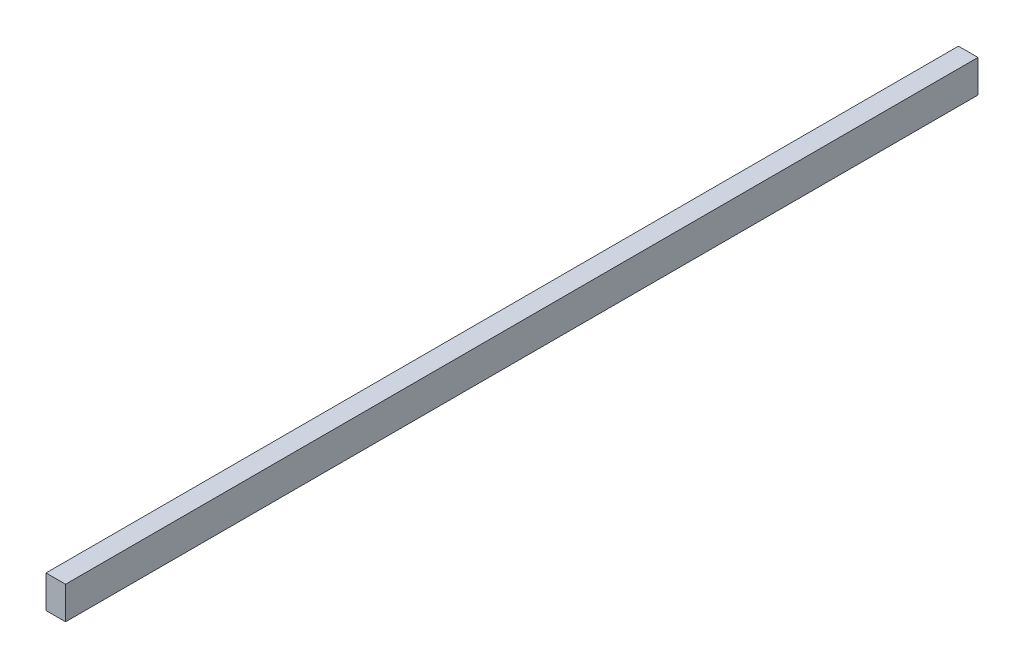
ISO-10303-21;
HEADER;
FILE_DESCRIPTION(('STEP AP214'),'2;1');
FILE_NAME('part.step','',(''),(''),'','','');
FILE_SCHEMA(('AUTOMOTIVE_DESIGN { 1 0 10303 214 1 1 1 1 }'));
ENDSEC;
DATA;
#1=APPLICATION_CONTEXT('core data for automotive mechanical design processes');
#2=APPLICATION_PROTOCOL_DEFINITION('international standard','automotive_design',2000,#1);
#3=PRODUCT_CONTEXT('',#1,'mechanical');
#4=PRODUCT('Part','Part','',(#3));
#5=PRODUCT_RELATED_PRODUCT_CATEGORY('part','',(#4));
#6=PRODUCT_DEFINITION_FORMATION('','',#4);
#7=PRODUCT_DEFINITION_CONTEXT('part definition',#1,'design');
#8=PRODUCT_DEFINITION('design','',#6,#7);
#9=PRODUCT_DEFINITION_SHAPE('','',#8);
#10=(LENGTH_UNIT() NAMED_UNIT(*) SI_UNIT(.MILLI.,.METRE.));
#11=(NAMED_UNIT(*) PLANE_ANGLE_UNIT() SI_UNIT($,.RADIAN.));
#12=(NAMED_UNIT(*) SI_UNIT($,.STERADIAN.) SOLID_ANGLE_UNIT());
#13=UNCERTAINTY_MEASURE_WITH_UNIT(LENGTH_MEASURE(1.E-05),#10,'distance_accuracy_value','');
#14=(GEOMETRIC_REPRESENTATION_CONTEXT(3) GLOBAL_UNCERTAINTY_ASSIGNED_CONTEXT((#13)) GLOBAL_UNIT_ASSIGNED_CONTEXT((#10,
#11,#12)) REPRESENTATION_CONTEXT('',''));
#15=CARTESIAN_POINT('',(0.,0.,0.));
#16=DIRECTION('',(0.,0.,1.));
#17=DIRECTION('',(1.,0.,0.));
#18=AXIS2_PLACEMENT_3D('',#15,#16,#17);
#19=CARTESIAN_POINT('',(0.,0.,840.));
#20=DIRECTION('',(1.,0.,0.));
#21=DIRECTION('',(0.,0.,-1.));
#22=AXIS2_PLACEMENT_3D('',#19,#20,#21);
#23=PLANE('',#22);
#24=DIRECTION('',(0.,-1.,0.));
#25=VECTOR('',#24,1.);
#26=CARTESIAN_POINT('',(0.,0.,0.));
#27=LINE('',#26,#25);
#28=CARTESIAN_POINT('',(0.,30.,0.));
#29=VERTEX_POINT('',#28);
#30=CARTESIAN_POINT('',(0.,0.,0.));
#31=VERTEX_POINT('',#30);
#32=EDGE_CURVE('E70',#29,#31,#27,.T.);
#33=ORIENTED_EDGE('',*,*,#32,.T.);
#34=DIRECTION('',(0.,0.,-1.));
#35=VECTOR('',#34,1.);
#36=CARTESIAN_POINT('',(0.,0.,840.));
#37=LINE('',#36,#35);
#38=CARTESIAN_POINT('',(0.,0.,840.));
#39=VERTEX_POINT('',#38);
#40=EDGE_CURVE('E11',#39,#31,#37,.T.);
#41=ORIENTED_EDGE('',*,*,#40,.F.);
#42=DIRECTION('',(0.,-1.,0.));
#43=VECTOR('',#42,1.);
#44=CARTESIAN_POINT('',(0.,0.,840.));
#45=LINE('',#44,#43);
#46=CARTESIAN_POINT('',(0.,30.,840.));
#47=VERTEX_POINT('',#46);
#48=EDGE_CURVE('E88',#47,#39,#45,.T.);
#49=ORIENTED_EDGE('',*,*,#48,.F.);
#50=DIRECTION('',(0.,0.,-1.));
#51=VECTOR('',#50,1.);
#52=CARTESIAN_POINT('',(0.,30.,840.));
#53=LINE('',#52,#51);
#54=EDGE_CURVE('E82',#47,#29,#53,.T.);
#55=ORIENTED_EDGE('',*,*,#54,.T.);
#56=EDGE_LOOP('',(#33,#41,#49,#55));
#57=FACE_BOUND('',#56,.T.);
#58=ADVANCED_FACE('F26',(#57),#23,.F.);
#59=CARTESIAN_POINT('',(0.,0.,840.));
#60=DIRECTION('',(0.,1.,0.));
#61=DIRECTION('',(0.,0.,1.));
#62=AXIS2_PLACEMENT_3D('',#59,#60,#61);
#63=PLANE('',#62);
#64=DIRECTION('',(1.,0.,0.));
#65=VECTOR('',#64,1.);
#66=CARTESIAN_POINT('',(0.,0.,0.));
#67=LINE('',#66,#65);
#68=CARTESIAN_POINT('',(18.,0.,0.));
#69=VERTEX_POINT('',#68);
#70=EDGE_CURVE('E66',#31,#69,#67,.T.);
#71=ORIENTED_EDGE('',*,*,#70,.T.);
#72=DIRECTION('',(0.,0.,-1.));
#73=VECTOR('',#72,1.);
#74=CARTESIAN_POINT('',(18.,0.,840.));
#75=LINE('',#74,#73);
#76=CARTESIAN_POINT('',(18.,0.,840.));
#77=VERTEX_POINT('',#76);
#78=EDGE_CURVE('E33',#77,#69,#75,.T.);
#79=ORIENTED_EDGE('',*,*,#78,.F.);
#80=DIRECTION('',(1.,0.,0.));
#81=VECTOR('',#80,1.);
#82=CARTESIAN_POINT('',(0.,0.,840.));
#83=LINE('',#82,#81);
#84=EDGE_CURVE('E78',#39,#77,#83,.T.);
#85=ORIENTED_EDGE('',*,*,#84,.F.);
#86=ORIENTED_EDGE('',*,*,#40,.T.);
#87=EDGE_LOOP('',(#71,#79,#85,#86));
#88=FACE_BOUND('',#87,.T.);
#89=ADVANCED_FACE('F77',(#88),#63,.F.);
#90=CARTESIAN_POINT('',(18.,0.,840.));
#91=DIRECTION('',(-1.,0.,0.));
#92=DIRECTION('',(0.,0.,1.));
#93=AXIS2_PLACEMENT_3D('',#90,#91,#92);
#94=PLANE('',#93);
#95=DIRECTION('',(0.,1.,0.));
#96=VECTOR('',#95,1.);
#97=CARTESIAN_POINT('',(18.,0.,0.));
#98=LINE('',#97,#96);
#99=CARTESIAN_POINT('',(18.,30.,0.));
#100=VERTEX_POINT('',#99);
#101=EDGE_CURVE('E71',#69,#100,#98,.T.);
#102=ORIENTED_EDGE('',*,*,#101,.T.);
#103=DIRECTION('',(0.,0.,-1.));
#104=VECTOR('',#103,1.);
#105=CARTESIAN_POINT('',(18.,30.,840.));
#106=LINE('',#105,#104);
#107=CARTESIAN_POINT('',(18.,30.,840.));
#108=VERTEX_POINT('',#107);
#109=EDGE_CURVE('E94',#108,#100,#106,.T.);
#110=ORIENTED_EDGE('',*,*,#109,.F.);
#111=DIRECTION('',(0.,1.,0.));
#112=VECTOR('',#111,1.);
#113=CARTESIAN_POINT('',(18.,0.,840.));
#114=LINE('',#113,#112);
#115=EDGE_CURVE('E45',#77,#108,#114,.T.);
#116=ORIENTED_EDGE('',*,*,#115,.F.);
#117=ORIENTED_EDGE('',*,*,#78,.T.);
#118=EDGE_LOOP('',(#102,#110,#116,#117));
#119=FACE_BOUND('',#118,.T.);
#120=ADVANCED_FACE('F97',(#119),#94,.F.);
#121=CARTESIAN_POINT('',(0.,30.,840.));
#122=DIRECTION('',(0.,-1.,0.));
#123=DIRECTION('',(0.,0.,-1.));
#124=AXIS2_PLACEMENT_3D('',#121,#122,#123);
#125=PLANE('',#124);
#126=DIRECTION('',(-1.,0.,0.));
#127=VECTOR('',#126,1.);
#128=CARTESIAN_POINT('',(0.,30.,0.));
#129=LINE('',#128,#127);
#130=EDGE_CURVE('E86',#100,#29,#129,.T.);
#131=ORIENTED_EDGE('',*,*,#130,.T.);
#132=ORIENTED_EDGE('',*,*,#54,.F.);
#133=DIRECTION('',(-1.,0.,0.));
#134=VECTOR('',#133,1.);
#135=CARTESIAN_POINT('',(0.,30.,840.));
#136=LINE('',#135,#134);
#137=EDGE_CURVE('E40',#108,#47,#136,.T.);
#138=ORIENTED_EDGE('',*,*,#137,.F.);
#139=ORIENTED_EDGE('',*,*,#109,.T.);
#140=EDGE_LOOP('',(#131,#132,#138,#139));
#141=FACE_BOUND('',#140,.T.);
#142=ADVANCED_FACE('F99',(#141),#125,.F.);
#143=CARTESIAN_POINT('',(0.,30.,840.));
#144=DIRECTION('',(0.,0.,-1.));
#145=DIRECTION('',(-1.,0.,0.));
#146=AXIS2_PLACEMENT_3D('',#143,#144,#145);
#147=PLANE('',#146);
#148=ORIENTED_EDGE('',*,*,#48,.T.);
#149=ORIENTED_EDGE('',*,*,#84,.T.);
#150=ORIENTED_EDGE('',*,*,#115,.T.);
#151=ORIENTED_EDGE('',*,*,#137,.T.);
#152=EDGE_LOOP('',(#148,#149,#150,#151));
#153=FACE_BOUND('',#152,.T.);
#154=ADVANCED_FACE('F100',(#153),#147,.F.);
#155=CARTESIAN_POINT('',(0.,30.,0.));
#156=DIRECTION('',(0.,0.,-1.));
#157=DIRECTION('',(-1.,0.,0.));
#158=AXIS2_PLACEMENT_3D('',#155,#156,#157);
#159=PLANE('',#158);
#160=ORIENTED_EDGE('',*,*,#32,.F.);
#161=ORIENTED_EDGE('',*,*,#130,.F.);
#162=ORIENTED_EDGE('',*,*,#101,.F.);
#163=ORIENTED_EDGE('',*,*,#70,.F.);
#164=EDGE_LOOP('',(#160,#161,#162,#163));
#165=FACE_BOUND('',#164,.T.);
#166=ADVANCED_FACE('F67',(#165),#159,.T.);
#167=CLOSED_SHELL('',(#58,#89,#120,#142,#154,#166));
#168=MANIFOLD_SOLID_BREP('B2',#167);
#169=ADVANCED_BREP_SHAPE_REPRESENTATION('',(#18,#168),#14);
#170=SHAPE_DEFINITION_REPRESENTATION(#9,#169);
ENDSEC;
END-ISO-10303-21;
